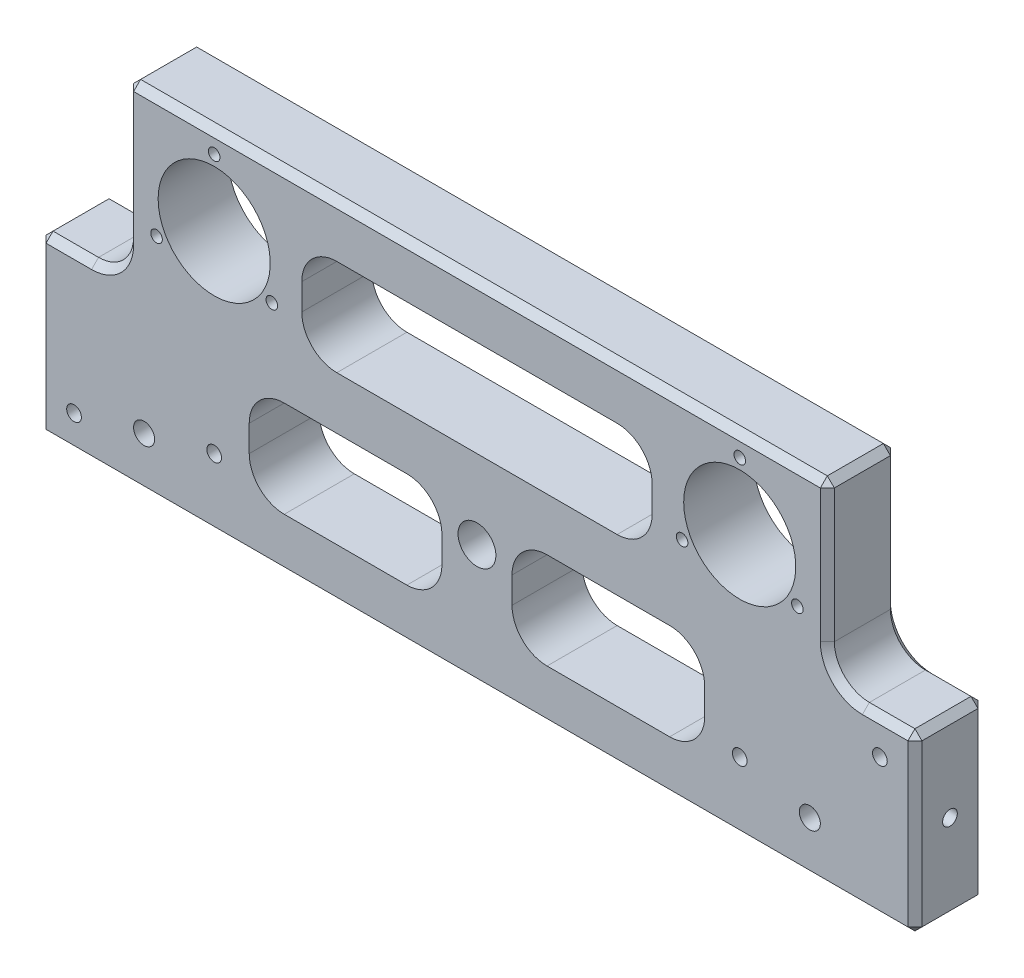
from build123d import *

# Parameters (mm, degrees)
ESQUISSE1_W               = 250
ESQUISSE1_H               = 100
BOSS_EXTRU_1_DEPTH        = 20
ESQUISSE2_W               = 25
ESQUISSE2_H               = 50
ENL_V_MAT_EXTRU_1_DEPTH   = 137.106575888
ESQUISSE3_W               = 25
ESQUISSE3_H               = 50
ENL_V_MAT_EXTRU_2_DEPTH   = 137.106575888
ESQUISSE4_W               = 100
ESQUISSE4_H               = 27.5
ENL_V_MAT_EXTRU_3_DEPTH   = 137.106575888
ESQUISSE5_W               = 55
ESQUISSE5_H               = 27.5
ENL_V_MAT_EXTRU_4_DEPTH   = 137.106575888
ESQUISSE6_W               = 55
ESQUISSE6_H               = 27.5
ENL_V_MAT_EXTRU_5_DEPTH   = 137.106575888
D_GAGEMENT_M271_D         = 32
TROU_TARAUD_M5X0_85_D     = 4.2
TROU_TARAUD_M12X1_251_D   = 10.8
TROU_TARAUD_M4X0_71_D     = 3.3
TROU_TARAUD_M5X0_84_D     = 4.2
TROU_TARAUD_M5X0_83_D     = 4.2
TROU_TARAUD_M5X0_83_DEPTH = 16
TROU_TARAUD_M5X0_83_TIP   = 1.2618073
TROU_TARAUD_M5X0_81_D     = 4.2
TROU_TARAUD_M5X0_81_DEPTH = 16
TROU_TARAUD_M5X0_81_TIP   = 1.2618073
TROU_TARAUD_M5X0_82_D     = 4.2
TROU_TARAUD_M5X0_82_DEPTH = 16
TROU_TARAUD_M5X0_82_TIP   = 1.2618073
CONG_1_R                  = 10
CHANFREIN1_SIZE           = 2
ESQUISSE23_R              = 3
ENL_V_MAT_EXTRU_6_DEPTH   = 137.106575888


with BuildPart() as part:
    # Esquisse1 → Boss.-Extru.1 (new body)
    with BuildSketch(Plane.XY.offset(20)):
        Rectangle(ESQUISSE1_W, ESQUISSE1_H)
    extrude(amount=-BOSS_EXTRU_1_DEPTH)

    # Esquisse2 → Enl_v. mat.-Extru.1 (cut, through all)
    with BuildSketch(Plane(origin=(0, 0, 0), x_dir=(-1, 0, 0), z_dir=(0, 0, -1))):
        with Locations((112.5, 25)):
            Rectangle(ESQUISSE2_W, ESQUISSE2_H)
    extrude(amount=-ENL_V_MAT_EXTRU_1_DEPTH, mode=Mode.SUBTRACT)

    # Esquisse3 → Enl_v. mat.-Extru.2 (cut, through all)
    with BuildSketch(Plane(origin=(0, 0, 0), x_dir=(-1, 0, 0), z_dir=(0, 0, -1))):
        with Locations((-112.5, 25)):
            Rectangle(ESQUISSE3_W, ESQUISSE3_H)
    extrude(amount=-ENL_V_MAT_EXTRU_2_DEPTH, mode=Mode.SUBTRACT)

    # Esquisse4 → Enl_v. mat.-Extru.3 (cut, through all)
    with BuildSketch(Plane.XY.offset(20)):
        with Locations((0, 21.25)):
            Rectangle(ESQUISSE4_W, ESQUISSE4_H)
    extrude(amount=-ENL_V_MAT_EXTRU_3_DEPTH, mode=Mode.SUBTRACT)

    # Esquisse5 → Enl_v. mat.-Extru.4 (cut, through all)
    with BuildSketch(Plane.XY.offset(20)):
        with Locations((-37.5, -21.25)):
            Rectangle(ESQUISSE5_W, ESQUISSE5_H)
    extrude(amount=-ENL_V_MAT_EXTRU_4_DEPTH, mode=Mode.SUBTRACT)

    # Esquisse6 → Enl_v. mat.-Extru.5 (cut, through all)
    with BuildSketch(Plane.XY.offset(20)):
        with Locations((37.5, -21.25)):
            Rectangle(ESQUISSE6_W, ESQUISSE6_H)
    extrude(amount=-ENL_V_MAT_EXTRU_5_DEPTH, mode=Mode.SUBTRACT)

    # D_gagement M271 (through all)
    with Locations(Plane(origin=(0, 0, 0), x_dir=(-1, 0, 0), z_dir=(0, 0, -1))):
        with Locations((75, 25), (-75, 25)):
            Hole(D_GAGEMENT_M271_D / 2)

    # Trou taraud_ M5x0.85 (through all)
    with Locations(Plane(origin=(0, 0, 0), x_dir=(-1, 0, 0), z_dir=(0, 0, -1))):
        with Locations((75, -30), (-75, -30)):
            Hole(TROU_TARAUD_M5X0_85_D / 2)

    # Trou taraud_ M12x1.251 (through all)
    with Locations(Plane(origin=(0, 0, 0), x_dir=(-1, 0, 0), z_dir=(0, 0, -1))):
        with Locations((0, -15)):
            Hole(TROU_TARAUD_M12X1_251_D / 2)

    # Trou taraud_ M4x0.71 (through all)
    with Locations(Plane(origin=(0, 0, 0), x_dir=(-1, 0, 0), z_dir=(0, 0, -1))):
        with Locations((91.454482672, 15.5), (75, 44), (58.545517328, 15.5), (-75, 44), (-91.454482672, 15.5), (-58.545517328, 15.5)):
            Hole(TROU_TARAUD_M4X0_71_D / 2)

    # Trou taraud_ M5x0.84 (through all)
    with Locations(Plane.XY.offset(20)):
        with Locations((115, -10), (-115, -40)):
            Hole(TROU_TARAUD_M5X0_84_D / 2)

    # Trou taraud_ M5x0.83
    with Locations(Plane.ZY.offset(125)):
        with Locations((10, -25)):
            Hole(TROU_TARAUD_M5X0_83_D / 2, depth=TROU_TARAUD_M5X0_83_DEPTH)
            with Locations((0, 0, -(TROU_TARAUD_M5X0_83_DEPTH + TROU_TARAUD_M5X0_83_TIP / 2))):  # 118° drill point
                Cone(0, TROU_TARAUD_M5X0_83_D / 2, TROU_TARAUD_M5X0_83_TIP, mode=Mode.SUBTRACT)

    # Trou taraud_ M5x0.81
    with Locations(Plane(origin=(0, -50, 0), x_dir=(-1, 0, 0), z_dir=(0, -1, 0))):
        with Locations((0, -10), (-105, -10), (105, -10)):
            Hole(TROU_TARAUD_M5X0_81_D / 2, depth=TROU_TARAUD_M5X0_81_DEPTH)
            with Locations((0, 0, -(TROU_TARAUD_M5X0_81_DEPTH + TROU_TARAUD_M5X0_81_TIP / 2))):  # 118° drill point
                Cone(0, TROU_TARAUD_M5X0_81_D / 2, TROU_TARAUD_M5X0_81_TIP, mode=Mode.SUBTRACT)

    # Trou taraud_ M5x0.82
    with Locations(Plane(origin=(125, 0, 0), x_dir=(0, 0, -1), z_dir=(1, 0, 0))):
        with Locations((-10, -25)):
            Hole(TROU_TARAUD_M5X0_82_D / 2, depth=TROU_TARAUD_M5X0_82_DEPTH)
            with Locations((0, 0, -(TROU_TARAUD_M5X0_82_DEPTH + TROU_TARAUD_M5X0_82_TIP / 2))):  # 118° drill point
                Cone(0, TROU_TARAUD_M5X0_82_D / 2, TROU_TARAUD_M5X0_82_TIP, mode=Mode.SUBTRACT)

    # Cong_1
    cong_1_edges = [part.edges().sort_by_distance(p)[0] for p in [
        (-100, 0, 10),
        (100, 0, 10),
        (50, 7.5, 10),
        (-50, 7.5, 10),
        (-50, 35, 10),
        (50, 35, 10),
        (-10, -35, 10),
        (-65, -35, 10),
        (-65, -7.5, 10),
        (-10, -7.5, 10),
        (10, -7.5, 10),
        (65, -7.5, 10),
        (65, -35, 10),
        (10, -35, 10),
    ]]
    fillet(cong_1_edges, radius=CONG_1_R)

    # Chanfrein1
    chanfrein1_edges = [part.edges().sort_by_distance(p)[0] for p in [
        (0, -50, 0),
        (-125, -25, 20),
        (-125, -25, 0),
        (-100, 30, 20),
        (-100, 50, 10),
        (-125, 0, 10),
        (-100, 30, 0),
        (-117.5, 0, 0),
        (-117.5, 0, 20),
        (100, 30, 0),
        (100, 30, 20),
        (-102.928932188, 2.928932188, 0),
        (-102.928932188, 2.928932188, 20),
        (102.928932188, 2.928932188, 0),
        (102.928932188, 2.928932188, 20),
        (0, 50, 20),
        (0, 50, 0),
        (125, 0, 10),
        (100, 50, 10),
        (117.5, 0, 20),
        (117.5, 0, 0),
        (125, -25, 0),
        (0, -50, 20),
        (125, -25, 20),
        (125, -50, 10),
        (-125, -50, 10),
    ]]
    chamfer(chanfrein1_edges, length=CHANFREIN1_SIZE)

    # Esquisse23 → Enl_v. mat.-Extru.6 (cut, through all)
    with BuildSketch(Plane.XY.offset(20)):
        with Locations((-95, -35)):
            Circle(ESQUISSE23_R)
        with Locations((95, -35)):
            Circle(ESQUISSE23_R)
    extrude(amount=-ENL_V_MAT_EXTRU_6_DEPTH, mode=Mode.SUBTRACT)


solid = part.part
